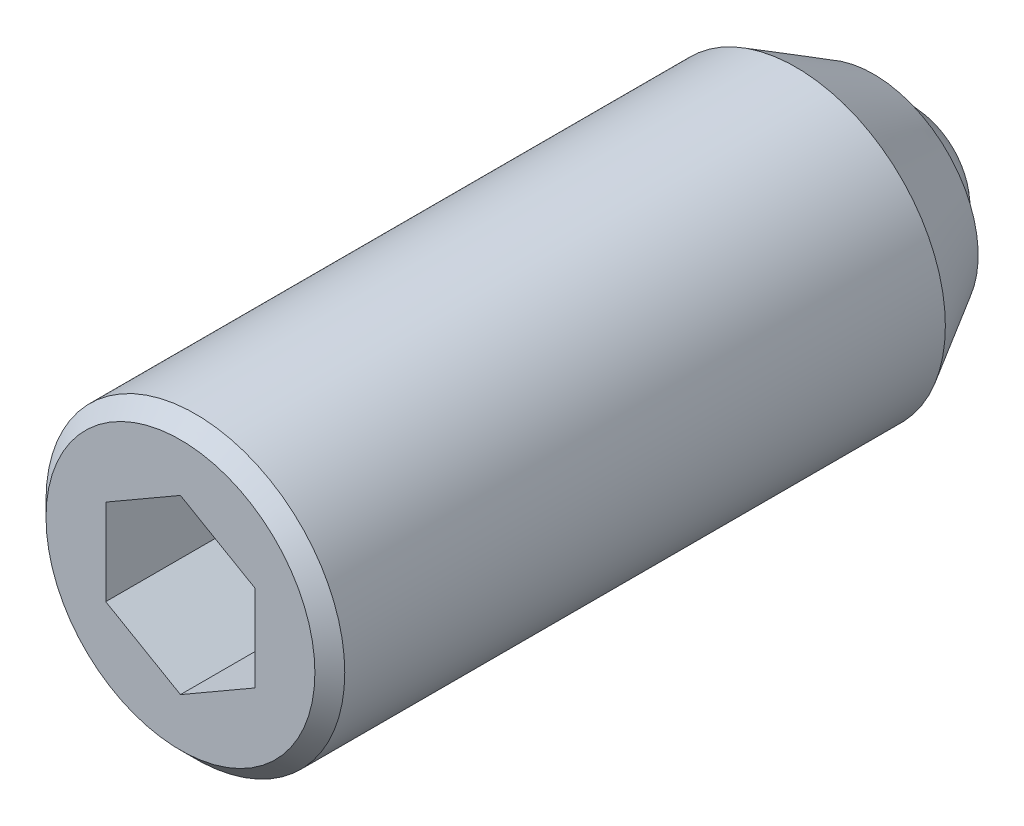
ISO-10303-21;
HEADER;
FILE_DESCRIPTION(('STEP AP214'),'2;1');
FILE_NAME('part.step','',(''),(''),'','','');
FILE_SCHEMA(('AUTOMOTIVE_DESIGN { 1 0 10303 214 1 1 1 1 }'));
ENDSEC;
DATA;
#1=APPLICATION_CONTEXT('core data for automotive mechanical design processes');
#2=APPLICATION_PROTOCOL_DEFINITION('international standard','automotive_design',2000,#1);
#3=PRODUCT_CONTEXT('',#1,'mechanical');
#4=PRODUCT('Part','Part','',(#3));
#5=PRODUCT_RELATED_PRODUCT_CATEGORY('part','',(#4));
#6=PRODUCT_DEFINITION_FORMATION('','',#4);
#7=PRODUCT_DEFINITION_CONTEXT('part definition',#1,'design');
#8=PRODUCT_DEFINITION('design','',#6,#7);
#9=PRODUCT_DEFINITION_SHAPE('','',#8);
#10=(LENGTH_UNIT() NAMED_UNIT(*) SI_UNIT(.MILLI.,.METRE.));
#11=(NAMED_UNIT(*) PLANE_ANGLE_UNIT() SI_UNIT($,.RADIAN.));
#12=(NAMED_UNIT(*) SI_UNIT($,.STERADIAN.) SOLID_ANGLE_UNIT());
#13=UNCERTAINTY_MEASURE_WITH_UNIT(LENGTH_MEASURE(1.E-05),#10,'distance_accuracy_value','');
#14=(GEOMETRIC_REPRESENTATION_CONTEXT(3) GLOBAL_UNCERTAINTY_ASSIGNED_CONTEXT((#13)) GLOBAL_UNIT_ASSIGNED_CONTEXT((#10,
#11,#12)) REPRESENTATION_CONTEXT('',''));
#15=CARTESIAN_POINT('',(0.,0.,0.));
#16=DIRECTION('',(0.,0.,1.));
#17=DIRECTION('',(1.,0.,0.));
#18=AXIS2_PLACEMENT_3D('',#15,#16,#17);
#19=CARTESIAN_POINT('',(1.25,0.721687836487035,10.1));
#20=DIRECTION('',(0.5,0.866025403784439,0.));
#21=DIRECTION('',(0.866025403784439,-0.5,0.));
#22=AXIS2_PLACEMENT_3D('',#19,#20,#21);
#23=PLANE('',#22);
#24=DIRECTION('',(0.,0.,1.));
#25=VECTOR('',#24,1.);
#26=CARTESIAN_POINT('',(1.25,0.721687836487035,10.1));
#27=LINE('',#26,#25);
#28=CARTESIAN_POINT('',(1.25,0.721687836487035,10.1));
#29=VERTEX_POINT('',#28);
#30=CARTESIAN_POINT('',(1.25,0.721687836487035,12.6));
#31=VERTEX_POINT('',#30);
#32=EDGE_CURVE('E96',#29,#31,#27,.T.);
#33=ORIENTED_EDGE('',*,*,#32,.T.);
#34=DIRECTION('',(-0.866025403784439,0.5,0.));
#35=VECTOR('',#34,1.);
#36=CARTESIAN_POINT('',(1.25,0.721687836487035,12.6));
#37=LINE('',#36,#35);
#38=CARTESIAN_POINT('',(0.,1.44337567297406,12.6));
#39=VERTEX_POINT('',#38);
#40=EDGE_CURVE('E29',#31,#39,#37,.T.);
#41=ORIENTED_EDGE('',*,*,#40,.T.);
#42=DIRECTION('',(0.,0.,1.));
#43=VECTOR('',#42,1.);
#44=CARTESIAN_POINT('',(0.,1.44337567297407,10.1));
#45=LINE('',#44,#43);
#46=CARTESIAN_POINT('',(0.,1.44337567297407,10.1));
#47=VERTEX_POINT('',#46);
#48=EDGE_CURVE('E34',#47,#39,#45,.T.);
#49=ORIENTED_EDGE('',*,*,#48,.F.);
#50=DIRECTION('',(-0.866025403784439,0.5,0.));
#51=VECTOR('',#50,1.);
#52=CARTESIAN_POINT('',(1.25,0.721687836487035,10.1));
#53=LINE('',#52,#51);
#54=EDGE_CURVE('E90',#29,#47,#53,.T.);
#55=ORIENTED_EDGE('',*,*,#54,.F.);
#56=EDGE_LOOP('',(#33,#41,#49,#55));
#57=FACE_BOUND('',#56,.T.);
#58=ADVANCED_FACE('F14',(#57),#23,.F.);
#59=CARTESIAN_POINT('',(1.25,-0.721687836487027,10.1));
#60=DIRECTION('',(1.,0.,0.));
#61=DIRECTION('',(0.,-1.,0.));
#62=AXIS2_PLACEMENT_3D('',#59,#60,#61);
#63=PLANE('',#62);
#64=DIRECTION('',(0.,0.,1.));
#65=VECTOR('',#64,1.);
#66=CARTESIAN_POINT('',(1.25,-0.721687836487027,10.1));
#67=LINE('',#66,#65);
#68=CARTESIAN_POINT('',(1.25,-0.721687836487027,10.1));
#69=VERTEX_POINT('',#68);
#70=CARTESIAN_POINT('',(1.25,-0.721687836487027,12.6));
#71=VERTEX_POINT('',#70);
#72=EDGE_CURVE('E93',#69,#71,#67,.T.);
#73=ORIENTED_EDGE('',*,*,#72,.T.);
#74=DIRECTION('',(0.,1.,0.));
#75=VECTOR('',#74,1.);
#76=CARTESIAN_POINT('',(1.25,-0.721687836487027,12.6));
#77=LINE('',#76,#75);
#78=EDGE_CURVE('E150',#71,#31,#77,.T.);
#79=ORIENTED_EDGE('',*,*,#78,.T.);
#80=ORIENTED_EDGE('',*,*,#32,.F.);
#81=DIRECTION('',(0.,1.,0.));
#82=VECTOR('',#81,1.);
#83=CARTESIAN_POINT('',(1.25,-0.721687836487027,10.1));
#84=LINE('',#83,#82);
#85=EDGE_CURVE('E85',#69,#29,#84,.T.);
#86=ORIENTED_EDGE('',*,*,#85,.F.);
#87=EDGE_LOOP('',(#73,#79,#80,#86));
#88=FACE_BOUND('',#87,.T.);
#89=ADVANCED_FACE('F119',(#88),#63,.F.);
#90=CARTESIAN_POINT('',(1.25,-0.721687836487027,10.1));
#91=DIRECTION('',(-0.5,0.866025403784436,0.));
#92=DIRECTION('',(0.866025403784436,0.5,0.));
#93=AXIS2_PLACEMENT_3D('',#90,#91,#92);
#94=PLANE('',#93);
#95=DIRECTION('',(0.,0.,1.));
#96=VECTOR('',#95,1.);
#97=CARTESIAN_POINT('',(0.,-1.44337567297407,10.1));
#98=LINE('',#97,#96);
#99=CARTESIAN_POINT('',(0.,-1.44337567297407,10.1));
#100=VERTEX_POINT('',#99);
#101=CARTESIAN_POINT('',(0.,-1.44337567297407,12.6));
#102=VERTEX_POINT('',#101);
#103=EDGE_CURVE('E68',#100,#102,#98,.T.);
#104=ORIENTED_EDGE('',*,*,#103,.T.);
#105=DIRECTION('',(-0.866025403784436,-0.5,0.));
#106=VECTOR('',#105,1.);
#107=CARTESIAN_POINT('',(1.25,-0.721687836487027,12.6));
#108=LINE('',#107,#106);
#109=EDGE_CURVE('E144',#71,#102,#108,.T.);
#110=ORIENTED_EDGE('',*,*,#109,.F.);
#111=ORIENTED_EDGE('',*,*,#72,.F.);
#112=DIRECTION('',(-0.866025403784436,-0.5,0.));
#113=VECTOR('',#112,1.);
#114=CARTESIAN_POINT('',(1.25,-0.721687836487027,10.1));
#115=LINE('',#114,#113);
#116=EDGE_CURVE('E83',#69,#100,#115,.T.);
#117=ORIENTED_EDGE('',*,*,#116,.T.);
#118=EDGE_LOOP('',(#104,#110,#111,#117));
#119=FACE_BOUND('',#118,.T.);
#120=ADVANCED_FACE('F124',(#119),#94,.T.);
#121=CARTESIAN_POINT('',(-1.25,-0.721687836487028,10.1));
#122=DIRECTION('',(-0.5,-0.866025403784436,0.));
#123=DIRECTION('',(-0.866025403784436,0.5,0.));
#124=AXIS2_PLACEMENT_3D('',#121,#122,#123);
#125=PLANE('',#124);
#126=DIRECTION('',(0.,0.,1.));
#127=VECTOR('',#126,1.);
#128=CARTESIAN_POINT('',(-1.25,-0.721687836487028,10.1));
#129=LINE('',#128,#127);
#130=CARTESIAN_POINT('',(-1.25,-0.721687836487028,10.1));
#131=VERTEX_POINT('',#130);
#132=CARTESIAN_POINT('',(-1.25,-0.721687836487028,12.6));
#133=VERTEX_POINT('',#132);
#134=EDGE_CURVE('E56',#131,#133,#129,.T.);
#135=ORIENTED_EDGE('',*,*,#134,.T.);
#136=DIRECTION('',(0.866025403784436,-0.5,0.));
#137=VECTOR('',#136,1.);
#138=CARTESIAN_POINT('',(-1.25,-0.721687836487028,12.6));
#139=LINE('',#138,#137);
#140=EDGE_CURVE('E147',#133,#102,#139,.T.);
#141=ORIENTED_EDGE('',*,*,#140,.T.);
#142=ORIENTED_EDGE('',*,*,#103,.F.);
#143=DIRECTION('',(0.866025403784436,-0.5,0.));
#144=VECTOR('',#143,1.);
#145=CARTESIAN_POINT('',(-1.25,-0.721687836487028,10.1));
#146=LINE('',#145,#144);
#147=EDGE_CURVE('E76',#131,#100,#146,.T.);
#148=ORIENTED_EDGE('',*,*,#147,.F.);
#149=EDGE_LOOP('',(#135,#141,#142,#148));
#150=FACE_BOUND('',#149,.T.);
#151=ADVANCED_FACE('F81',(#150),#125,.F.);
#152=CARTESIAN_POINT('',(-1.25,-0.721687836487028,10.1));
#153=DIRECTION('',(1.,0.,0.));
#154=DIRECTION('',(0.,0.,1.));
#155=AXIS2_PLACEMENT_3D('',#152,#153,#154);
#156=PLANE('',#155);
#157=DIRECTION('',(0.,0.,1.));
#158=VECTOR('',#157,1.);
#159=CARTESIAN_POINT('',(-1.25,0.72168783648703,10.1));
#160=LINE('',#159,#158);
#161=CARTESIAN_POINT('',(-1.25,0.72168783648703,10.1));
#162=VERTEX_POINT('',#161);
#163=CARTESIAN_POINT('',(-1.25,0.72168783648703,12.6));
#164=VERTEX_POINT('',#163);
#165=EDGE_CURVE('E69',#162,#164,#160,.T.);
#166=ORIENTED_EDGE('',*,*,#165,.T.);
#167=DIRECTION('',(0.,1.,0.));
#168=VECTOR('',#167,1.);
#169=CARTESIAN_POINT('',(-1.25,-0.721687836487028,12.6));
#170=LINE('',#169,#168);
#171=EDGE_CURVE('E63',#133,#164,#170,.T.);
#172=ORIENTED_EDGE('',*,*,#171,.F.);
#173=ORIENTED_EDGE('',*,*,#134,.F.);
#174=DIRECTION('',(0.,1.,0.));
#175=VECTOR('',#174,1.);
#176=CARTESIAN_POINT('',(-1.25,-0.721687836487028,10.1));
#177=LINE('',#176,#175);
#178=EDGE_CURVE('E60',#131,#162,#177,.T.);
#179=ORIENTED_EDGE('',*,*,#178,.T.);
#180=EDGE_LOOP('',(#166,#172,#173,#179));
#181=FACE_BOUND('',#180,.T.);
#182=ADVANCED_FACE('F59',(#181),#156,.T.);
#183=CARTESIAN_POINT('',(-1.25,0.72168783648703,10.1));
#184=DIRECTION('',(0.5,-0.866025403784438,0.));
#185=DIRECTION('',(-0.866025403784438,-0.5,0.));
#186=AXIS2_PLACEMENT_3D('',#183,#184,#185);
#187=PLANE('',#186);
#188=DIRECTION('',(0.866025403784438,0.5,0.));
#189=VECTOR('',#188,1.);
#190=CARTESIAN_POINT('',(-1.25,0.72168783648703,10.1));
#191=LINE('',#190,#189);
#192=EDGE_CURVE('E79',#162,#47,#191,.T.);
#193=ORIENTED_EDGE('',*,*,#192,.T.);
#194=ORIENTED_EDGE('',*,*,#48,.T.);
#195=DIRECTION('',(0.866025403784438,0.5,0.));
#196=VECTOR('',#195,1.);
#197=CARTESIAN_POINT('',(-1.25,0.72168783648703,12.6));
#198=LINE('',#197,#196);
#199=EDGE_CURVE('E157',#164,#39,#198,.T.);
#200=ORIENTED_EDGE('',*,*,#199,.F.);
#201=ORIENTED_EDGE('',*,*,#165,.F.);
#202=EDGE_LOOP('',(#193,#194,#200,#201));
#203=FACE_BOUND('',#202,.T.);
#204=ADVANCED_FACE('F128',(#203),#187,.T.);
#205=CARTESIAN_POINT('',(2.5,0.,10.1));
#206=DIRECTION('',(0.,0.,1.));
#207=DIRECTION('',(-1.,0.,0.));
#208=AXIS2_PLACEMENT_3D('',#205,#206,#207);
#209=PLANE('',#208);
#210=ORIENTED_EDGE('',*,*,#54,.T.);
#211=ORIENTED_EDGE('',*,*,#192,.F.);
#212=ORIENTED_EDGE('',*,*,#178,.F.);
#213=ORIENTED_EDGE('',*,*,#147,.T.);
#214=ORIENTED_EDGE('',*,*,#116,.F.);
#215=ORIENTED_EDGE('',*,*,#85,.T.);
#216=EDGE_LOOP('',(#210,#211,#212,#213,#214,#215));
#217=FACE_BOUND('',#216,.T.);
#218=ADVANCED_FACE('F74',(#217),#209,.T.);
#219=CARTESIAN_POINT('',(0.,0.,12.35));
#220=DIRECTION('',(0.,0.,-1.));
#221=DIRECTION('',(1.,0.,0.));
#222=AXIS2_PLACEMENT_3D('',#219,#220,#221);
#223=CYLINDRICAL_SURFACE('',#222,2.5);
#224=CARTESIAN_POINT('',(0.,0.,12.35));
#225=DIRECTION('',(0.,0.,-1.));
#226=DIRECTION('',(1.,0.,0.));
#227=AXIS2_PLACEMENT_3D('',#224,#225,#226);
#228=CIRCLE('',#227,2.5);
#229=CARTESIAN_POINT('',(2.5,0.,12.35));
#230=VERTEX_POINT('',#229);
#231=EDGE_CURVE('E9',#230,#230,#228,.T.);
#232=ORIENTED_EDGE('',*,*,#231,.T.);
#233=EDGE_LOOP('',(#232));
#234=FACE_BOUND('',#233,.T.);
#235=CARTESIAN_POINT('',(0.,0.,2.29903810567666));
#236=DIRECTION('',(0.,0.,-1.));
#237=DIRECTION('',(-1.,0.,0.));
#238=AXIS2_PLACEMENT_3D('',#235,#236,#237);
#239=CIRCLE('',#238,2.5);
#240=CARTESIAN_POINT('',(-2.5,0.,2.29903810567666));
#241=VERTEX_POINT('',#240);
#242=EDGE_CURVE('E172',#241,#241,#239,.T.);
#243=ORIENTED_EDGE('',*,*,#242,.F.);
#244=EDGE_LOOP('',(#243));
#245=FACE_BOUND('',#244,.T.);
#246=ADVANCED_FACE('F16',(#234,#245),#223,.T.);
#247=CARTESIAN_POINT('',(0.,0.,12.35));
#248=DIRECTION('',(0.,0.,-1.));
#249=DIRECTION('',(1.,0.,0.));
#250=AXIS2_PLACEMENT_3D('',#247,#248,#249);
#251=CONICAL_SURFACE('',#250,2.5,0.785398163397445);
#252=CARTESIAN_POINT('',(0.,0.,12.6));
#253=DIRECTION('',(0.,0.,-1.));
#254=DIRECTION('',(1.,0.,0.));
#255=AXIS2_PLACEMENT_3D('',#252,#253,#254);
#256=CIRCLE('',#255,2.25);
#257=CARTESIAN_POINT('',(2.25,0.,12.6));
#258=VERTEX_POINT('',#257);
#259=EDGE_CURVE('E22',#258,#258,#256,.T.);
#260=ORIENTED_EDGE('',*,*,#259,.T.);
#261=EDGE_LOOP('',(#260));
#262=FACE_BOUND('',#261,.T.);
#263=ORIENTED_EDGE('',*,*,#231,.F.);
#264=EDGE_LOOP('',(#263));
#265=FACE_BOUND('',#264,.T.);
#266=ADVANCED_FACE('F100',(#262,#265),#251,.T.);
#267=CARTESIAN_POINT('',(0.,0.,12.6));
#268=DIRECTION('',(0.,0.,-1.));
#269=DIRECTION('',(1.,0.,0.));
#270=AXIS2_PLACEMENT_3D('',#267,#268,#269);
#271=PLANE('',#270);
#272=ORIENTED_EDGE('',*,*,#199,.T.);
#273=ORIENTED_EDGE('',*,*,#40,.F.);
#274=ORIENTED_EDGE('',*,*,#78,.F.);
#275=ORIENTED_EDGE('',*,*,#109,.T.);
#276=ORIENTED_EDGE('',*,*,#140,.F.);
#277=ORIENTED_EDGE('',*,*,#171,.T.);
#278=EDGE_LOOP('',(#272,#273,#274,#275,#276,#277));
#279=FACE_BOUND('',#278,.T.);
#280=ORIENTED_EDGE('',*,*,#259,.F.);
#281=EDGE_LOOP('',(#280));
#282=FACE_BOUND('',#281,.T.);
#283=ADVANCED_FACE('F103',(#279,#282),#271,.F.);
#284=CARTESIAN_POINT('',(0.,0.,1.5));
#285=DIRECTION('',(0.,0.,-1.));
#286=DIRECTION('',(-1.,0.,0.));
#287=AXIS2_PLACEMENT_3D('',#284,#285,#286);
#288=SPHERICAL_SURFACE('',#287,1.5);
#289=CARTESIAN_POINT('',(0.,0.,1.));
#290=DIRECTION('',(0.,0.,-1.));
#291=DIRECTION('',(-1.,0.,0.));
#292=AXIS2_PLACEMENT_3D('',#289,#290,#291);
#293=CIRCLE('',#292,1.41421356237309);
#294=CARTESIAN_POINT('',(-1.41421356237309,0.,1.));
#295=VERTEX_POINT('',#294);
#296=EDGE_CURVE('E152',#295,#295,#293,.T.);
#297=ORIENTED_EDGE('',*,*,#296,.T.);
#298=EDGE_LOOP('',(#297));
#299=FACE_BOUND('',#298,.T.);
#300=ADVANCED_FACE('F105',(#299),#288,.T.);
#301=CARTESIAN_POINT('',(-1.41421356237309,0.,1.));
#302=DIRECTION('',(0.,0.,-1.));
#303=DIRECTION('',(-1.,0.,0.));
#304=AXIS2_PLACEMENT_3D('',#301,#302,#303);
#305=PLANE('',#304);
#306=CARTESIAN_POINT('',(0.,0.,1.));
#307=DIRECTION('',(0.,0.,-1.));
#308=DIRECTION('',(-1.,0.,0.));
#309=AXIS2_PLACEMENT_3D('',#306,#307,#308);
#310=CIRCLE('',#309,1.75);
#311=CARTESIAN_POINT('',(-1.75,0.,1.));
#312=VERTEX_POINT('',#311);
#313=EDGE_CURVE('E169',#312,#312,#310,.T.);
#314=ORIENTED_EDGE('',*,*,#313,.T.);
#315=EDGE_LOOP('',(#314));
#316=FACE_BOUND('',#315,.T.);
#317=ORIENTED_EDGE('',*,*,#296,.F.);
#318=EDGE_LOOP('',(#317));
#319=FACE_BOUND('',#318,.T.);
#320=ADVANCED_FACE('F113',(#316,#319),#305,.T.);
#321=CARTESIAN_POINT('',(0.,0.,1.));
#322=DIRECTION('',(0.,0.,1.));
#323=DIRECTION('',(1.,0.,0.));
#324=AXIS2_PLACEMENT_3D('',#321,#322,#323);
#325=CONICAL_SURFACE('',#324,1.75,0.523598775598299);
#326=ORIENTED_EDGE('',*,*,#242,.T.);
#327=EDGE_LOOP('',(#326));
#328=FACE_BOUND('',#327,.T.);
#329=ORIENTED_EDGE('',*,*,#313,.F.);
#330=EDGE_LOOP('',(#329));
#331=FACE_BOUND('',#330,.T.);
#332=ADVANCED_FACE('F176',(#328,#331),#325,.T.);
#333=CLOSED_SHELL('',(#58,#89,#120,#151,#182,#204,#218,#246,#266,#283,#300,#320,#332));
#334=MANIFOLD_SOLID_BREP('B1',#333);
#335=ADVANCED_BREP_SHAPE_REPRESENTATION('',(#18,#334),#14);
#336=SHAPE_DEFINITION_REPRESENTATION(#9,#335);
ENDSEC;
END-ISO-10303-21;
